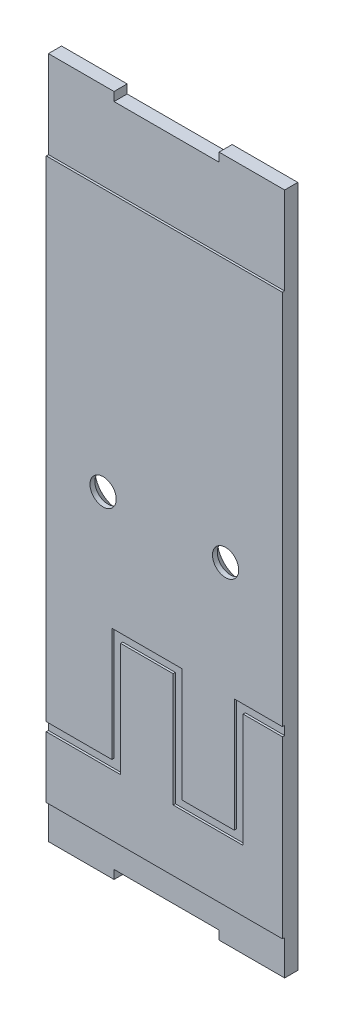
from build123d import *

# Parameters (mm, degrees)
SKETCH_1_W          = 27
SKETCH_1_H          = 78
EXTRUDE_1_DEPTH     = 1.5
SKETCH_3_W          = 27
SKETCH_3_H          = 78
EXTRUDE_2_DEPTH     = 0.25
SKETCH_5_W          = 27
SKETCH_5_H          = 10
SKETCH_5_H_2        = 4
CUT_EXTRUDE_1_DEPTH = 0.25
SKETCH_6_R          = 1.5
CUT_EXTRUDE_2_DEPTH = 83.559448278
CUT_EXTRUDE_3_DEPTH = 0.25
SKETCH_8_W          = 12
SKETCH_8_H          = 1
CUT_EXTRUDE_4_DEPTH = 83.554527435
CHAMFER_1_SIZE      = 1.2


with BuildPart() as part:
    # Sketch 1 → Extrude 1 (new body)
    with BuildSketch(Plane.XY):
        with Locations((13.5, 39)):
            Rectangle(SKETCH_1_W, SKETCH_1_H)
    extrude(amount=EXTRUDE_1_DEPTH)

    # Sketch 3 → Extrude 2 (add)
    with BuildSketch(Plane.XY.offset(1.5)):
        with Locations((13.5, 39)):
            Rectangle(SKETCH_3_W, SKETCH_3_H)
    extrude(amount=EXTRUDE_2_DEPTH)

    # Sketch 5 → Cut-Extrude 1 (cut)
    with BuildSketch(Plane.XY.offset(1.75)):
        with Locations((13.5, 73)):
            Rectangle(SKETCH_5_W, SKETCH_5_H)
        with Locations((13.5, 2)):
            Rectangle(SKETCH_5_W, SKETCH_5_H_2)
    extrude(amount=-CUT_EXTRUDE_1_DEPTH, mode=Mode.SUBTRACT)

    # Sketch 6 → Cut-Extrude 2 (cut, through all)
    with BuildSketch(Plane.XY.offset(1.75)):
        with Locations((20.5, 38)):
            Circle(SKETCH_6_R)
        with Locations(Location((6.5, 38, 0), (0, 0, 180))):
            Circle(SKETCH_6_R)
    extrude(amount=-CUT_EXTRUDE_2_DEPTH, mode=Mode.SUBTRACT)

    # Sketch 7 → Cut-Extrude 3 (cut)
    with BuildSketch(Plane.XY.offset(1.75)):
        Polygon((21.5, 25), (27, 25), (27, 24), (22.5, 24), (22.5, 11), (14.5, 11), (14.5, 24), (8.5, 24), (8.5, 11), (0, 11), (0, 12), (7.5, 12), (7.5, 25), (15.5, 25), (15.5, 12), (21.5, 12), align=None)
    extrude(amount=-CUT_EXTRUDE_3_DEPTH, mode=Mode.SUBTRACT)

    # Sketch 8 → Cut-Extrude 4 (cut, through all)
    with BuildSketch(Plane.XY.offset(1.5)):
        with Locations((13.5, 77.5)):
            Rectangle(SKETCH_8_W, SKETCH_8_H)
        with Locations((13.5, 0.5)):
            Rectangle(SKETCH_8_W, SKETCH_8_H)
    extrude(amount=-CUT_EXTRUDE_4_DEPTH, mode=Mode.SUBTRACT)

    # Chamfer 1
    chamfer_1_edges = [part.edges().sort_by_distance(p)[0] for p in [
        (19, 38, 0),
        (8, 38, 0),
    ]]
    chamfer(chamfer_1_edges, length=CHAMFER_1_SIZE)


solid = part.part
